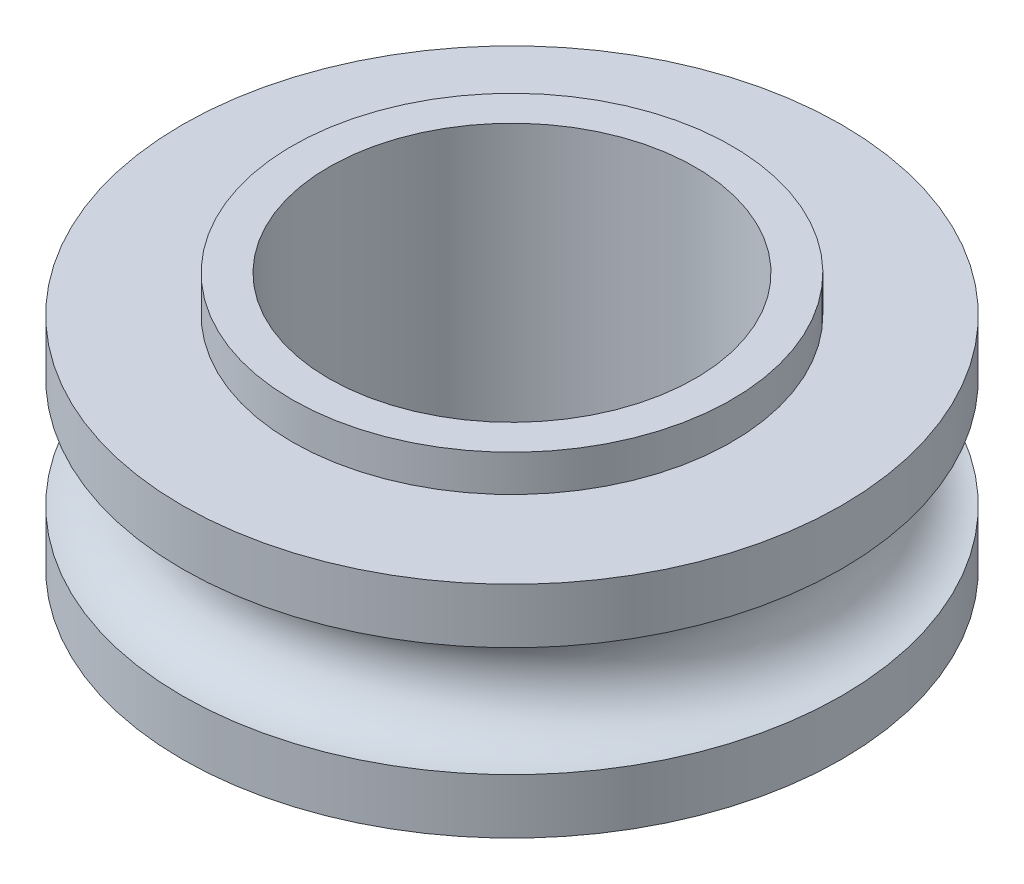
ISO-10303-21;
HEADER;
FILE_DESCRIPTION(('STEP AP214'),'2;1');
FILE_NAME('part.step','',(''),(''),'','','');
FILE_SCHEMA(('AUTOMOTIVE_DESIGN { 1 0 10303 214 1 1 1 1 }'));
ENDSEC;
DATA;
#1=APPLICATION_CONTEXT('core data for automotive mechanical design processes');
#2=APPLICATION_PROTOCOL_DEFINITION('international standard','automotive_design',2000,#1);
#3=PRODUCT_CONTEXT('',#1,'mechanical');
#4=PRODUCT('Part','Part','',(#3));
#5=PRODUCT_RELATED_PRODUCT_CATEGORY('part','',(#4));
#6=PRODUCT_DEFINITION_FORMATION('','',#4);
#7=PRODUCT_DEFINITION_CONTEXT('part definition',#1,'design');
#8=PRODUCT_DEFINITION('design','',#6,#7);
#9=PRODUCT_DEFINITION_SHAPE('','',#8);
#10=(LENGTH_UNIT() NAMED_UNIT(*) SI_UNIT(.MILLI.,.METRE.));
#11=(NAMED_UNIT(*) PLANE_ANGLE_UNIT() SI_UNIT($,.RADIAN.));
#12=(NAMED_UNIT(*) SI_UNIT($,.STERADIAN.) SOLID_ANGLE_UNIT());
#13=UNCERTAINTY_MEASURE_WITH_UNIT(LENGTH_MEASURE(1.E-05),#10,'distance_accuracy_value','');
#14=(GEOMETRIC_REPRESENTATION_CONTEXT(3) GLOBAL_UNCERTAINTY_ASSIGNED_CONTEXT((#13)) GLOBAL_UNIT_ASSIGNED_CONTEXT((#10,
#11,#12)) REPRESENTATION_CONTEXT('',''));
#15=CARTESIAN_POINT('',(0.,0.,0.));
#16=DIRECTION('',(0.,0.,1.));
#17=DIRECTION('',(1.,0.,0.));
#18=AXIS2_PLACEMENT_3D('',#15,#16,#17);
#19=CARTESIAN_POINT('',(0.,26.6473214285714,0.));
#20=DIRECTION('',(0.,1.,0.));
#21=DIRECTION('',(0.,0.,1.));
#22=AXIS2_PLACEMENT_3D('',#19,#20,#21);
#23=CYLINDRICAL_SURFACE('',#22,15.875);
#24=CARTESIAN_POINT('',(0.,-12.7,0.));
#25=DIRECTION('',(0.,1.,0.));
#26=DIRECTION('',(0.,0.,1.));
#27=AXIS2_PLACEMENT_3D('',#24,#25,#26);
#28=CIRCLE('',#27,15.875);
#29=CARTESIAN_POINT('',(0.,-12.7,15.875));
#30=VERTEX_POINT('',#29);
#31=EDGE_CURVE('E10',#30,#30,#28,.T.);
#32=ORIENTED_EDGE('',*,*,#31,.F.);
#33=EDGE_LOOP('',(#32));
#34=FACE_BOUND('',#33,.T.);
#35=CARTESIAN_POINT('',(0.,12.7,0.));
#36=DIRECTION('',(0.,1.,0.));
#37=DIRECTION('',(0.,0.,1.));
#38=AXIS2_PLACEMENT_3D('',#35,#36,#37);
#39=CIRCLE('',#38,15.875);
#40=CARTESIAN_POINT('',(0.,12.7,15.875));
#41=VERTEX_POINT('',#40);
#42=EDGE_CURVE('E64',#41,#41,#39,.T.);
#43=ORIENTED_EDGE('',*,*,#42,.T.);
#44=EDGE_LOOP('',(#43));
#45=FACE_BOUND('',#44,.T.);
#46=ADVANCED_FACE('F30',(#34,#45),#23,.F.);
#47=CARTESIAN_POINT('',(15.875,-12.7,0.));
#48=DIRECTION('',(0.,1.,0.));
#49=DIRECTION('',(0.,0.,1.));
#50=AXIS2_PLACEMENT_3D('',#47,#48,#49);
#51=PLANE('',#50);
#52=CARTESIAN_POINT('',(0.,-12.7,0.));
#53=DIRECTION('',(0.,1.,0.));
#54=DIRECTION('',(0.,0.,1.));
#55=AXIS2_PLACEMENT_3D('',#52,#53,#54);
#56=CIRCLE('',#55,19.05);
#57=CARTESIAN_POINT('',(0.,-12.7,19.05));
#58=VERTEX_POINT('',#57);
#59=EDGE_CURVE('E36',#58,#58,#56,.T.);
#60=ORIENTED_EDGE('',*,*,#59,.F.);
#61=EDGE_LOOP('',(#60));
#62=FACE_BOUND('',#61,.T.);
#63=ORIENTED_EDGE('',*,*,#31,.T.);
#64=EDGE_LOOP('',(#63));
#65=FACE_BOUND('',#64,.T.);
#66=ADVANCED_FACE('F113',(#62,#65),#51,.F.);
#67=CARTESIAN_POINT('',(0.,26.6473214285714,0.));
#68=DIRECTION('',(0.,1.,0.));
#69=DIRECTION('',(0.,0.,1.));
#70=AXIS2_PLACEMENT_3D('',#67,#68,#69);
#71=CYLINDRICAL_SURFACE('',#70,19.05);
#72=CARTESIAN_POINT('',(0.,-9.525,0.));
#73=DIRECTION('',(0.,1.,0.));
#74=DIRECTION('',(0.,0.,1.));
#75=AXIS2_PLACEMENT_3D('',#72,#73,#74);
#76=CIRCLE('',#75,19.05);
#77=CARTESIAN_POINT('',(0.,-9.525,19.05));
#78=VERTEX_POINT('',#77);
#79=EDGE_CURVE('E40',#78,#78,#76,.T.);
#80=ORIENTED_EDGE('',*,*,#79,.F.);
#81=EDGE_LOOP('',(#80));
#82=FACE_BOUND('',#81,.T.);
#83=ORIENTED_EDGE('',*,*,#59,.T.);
#84=EDGE_LOOP('',(#83));
#85=FACE_BOUND('',#84,.T.);
#86=ADVANCED_FACE('F108',(#82,#85),#71,.T.);
#87=CARTESIAN_POINT('',(19.05,-9.525,0.));
#88=DIRECTION('',(0.,1.,0.));
#89=DIRECTION('',(0.,0.,1.));
#90=AXIS2_PLACEMENT_3D('',#87,#88,#89);
#91=PLANE('',#90);
#92=CARTESIAN_POINT('',(0.,-9.525,0.));
#93=DIRECTION('',(0.,1.,0.));
#94=DIRECTION('',(0.,0.,1.));
#95=AXIS2_PLACEMENT_3D('',#92,#93,#94);
#96=CIRCLE('',#95,28.575);
#97=CARTESIAN_POINT('',(0.,-9.525,28.575));
#98=VERTEX_POINT('',#97);
#99=EDGE_CURVE('E44',#98,#98,#96,.T.);
#100=ORIENTED_EDGE('',*,*,#99,.F.);
#101=EDGE_LOOP('',(#100));
#102=FACE_BOUND('',#101,.T.);
#103=ORIENTED_EDGE('',*,*,#79,.T.);
#104=EDGE_LOOP('',(#103));
#105=FACE_BOUND('',#104,.T.);
#106=ADVANCED_FACE('F102',(#102,#105),#91,.F.);
#107=CARTESIAN_POINT('',(0.,26.6473214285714,0.));
#108=DIRECTION('',(0.,1.,0.));
#109=DIRECTION('',(0.,0.,1.));
#110=AXIS2_PLACEMENT_3D('',#107,#108,#109);
#111=CYLINDRICAL_SURFACE('',#110,28.575);
#112=CARTESIAN_POINT('',(0.,-4.7625,0.));
#113=DIRECTION('',(0.,1.,0.));
#114=DIRECTION('',(0.,0.,1.));
#115=AXIS2_PLACEMENT_3D('',#112,#113,#114);
#116=CIRCLE('',#115,28.575);
#117=CARTESIAN_POINT('',(0.,-4.7625,28.575));
#118=VERTEX_POINT('',#117);
#119=EDGE_CURVE('E49',#118,#118,#116,.T.);
#120=ORIENTED_EDGE('',*,*,#119,.F.);
#121=EDGE_LOOP('',(#120));
#122=FACE_BOUND('',#121,.T.);
#123=ORIENTED_EDGE('',*,*,#99,.T.);
#124=EDGE_LOOP('',(#123));
#125=FACE_BOUND('',#124,.T.);
#126=ADVANCED_FACE('F96',(#122,#125),#111,.T.);
#127=CARTESIAN_POINT('',(0.,0.,0.));
#128=DIRECTION('',(0.,1.,0.));
#129=DIRECTION('',(0.,0.,1.));
#130=AXIS2_PLACEMENT_3D('',#127,#128,#129);
#131=TOROIDAL_SURFACE('',#130,28.575,4.7625);
#132=CARTESIAN_POINT('',(0.,4.7625,0.));
#133=DIRECTION('',(0.,1.,0.));
#134=DIRECTION('',(0.,0.,1.));
#135=AXIS2_PLACEMENT_3D('',#132,#133,#134);
#136=CIRCLE('',#135,28.575);
#137=CARTESIAN_POINT('',(0.,4.7625,28.575));
#138=VERTEX_POINT('',#137);
#139=EDGE_CURVE('E52',#138,#138,#136,.T.);
#140=ORIENTED_EDGE('',*,*,#139,.F.);
#141=EDGE_LOOP('',(#140));
#142=FACE_BOUND('',#141,.T.);
#143=ORIENTED_EDGE('',*,*,#119,.T.);
#144=EDGE_LOOP('',(#143));
#145=FACE_BOUND('',#144,.T.);
#146=ADVANCED_FACE('F90',(#142,#145),#131,.F.);
#147=CARTESIAN_POINT('',(0.,26.6473214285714,0.));
#148=DIRECTION('',(0.,1.,0.));
#149=DIRECTION('',(0.,0.,1.));
#150=AXIS2_PLACEMENT_3D('',#147,#148,#149);
#151=CYLINDRICAL_SURFACE('',#150,28.575);
#152=CARTESIAN_POINT('',(0.,9.525,0.));
#153=DIRECTION('',(0.,1.,0.));
#154=DIRECTION('',(0.,0.,1.));
#155=AXIS2_PLACEMENT_3D('',#152,#153,#154);
#156=CIRCLE('',#155,28.575);
#157=CARTESIAN_POINT('',(0.,9.525,28.575));
#158=VERTEX_POINT('',#157);
#159=EDGE_CURVE('E55',#158,#158,#156,.T.);
#160=ORIENTED_EDGE('',*,*,#159,.F.);
#161=EDGE_LOOP('',(#160));
#162=FACE_BOUND('',#161,.T.);
#163=ORIENTED_EDGE('',*,*,#139,.T.);
#164=EDGE_LOOP('',(#163));
#165=FACE_BOUND('',#164,.T.);
#166=ADVANCED_FACE('F84',(#162,#165),#151,.T.);
#167=CARTESIAN_POINT('',(19.05,9.525,0.));
#168=DIRECTION('',(0.,-1.,0.));
#169=DIRECTION('',(0.,0.,-1.));
#170=AXIS2_PLACEMENT_3D('',#167,#168,#169);
#171=PLANE('',#170);
#172=CARTESIAN_POINT('',(0.,9.525,0.));
#173=DIRECTION('',(0.,1.,0.));
#174=DIRECTION('',(0.,0.,1.));
#175=AXIS2_PLACEMENT_3D('',#172,#173,#174);
#176=CIRCLE('',#175,19.05);
#177=CARTESIAN_POINT('',(0.,9.525,19.05));
#178=VERTEX_POINT('',#177);
#179=EDGE_CURVE('E58',#178,#178,#176,.T.);
#180=ORIENTED_EDGE('',*,*,#179,.F.);
#181=EDGE_LOOP('',(#180));
#182=FACE_BOUND('',#181,.T.);
#183=ORIENTED_EDGE('',*,*,#159,.T.);
#184=EDGE_LOOP('',(#183));
#185=FACE_BOUND('',#184,.T.);
#186=ADVANCED_FACE('F78',(#182,#185),#171,.F.);
#187=CARTESIAN_POINT('',(0.,26.6473214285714,0.));
#188=DIRECTION('',(0.,1.,0.));
#189=DIRECTION('',(0.,0.,1.));
#190=AXIS2_PLACEMENT_3D('',#187,#188,#189);
#191=CYLINDRICAL_SURFACE('',#190,19.05);
#192=CARTESIAN_POINT('',(0.,12.7,0.));
#193=DIRECTION('',(0.,1.,0.));
#194=DIRECTION('',(0.,0.,1.));
#195=AXIS2_PLACEMENT_3D('',#192,#193,#194);
#196=CIRCLE('',#195,19.05);
#197=CARTESIAN_POINT('',(0.,12.7,19.05));
#198=VERTEX_POINT('',#197);
#199=EDGE_CURVE('E61',#198,#198,#196,.T.);
#200=ORIENTED_EDGE('',*,*,#199,.F.);
#201=EDGE_LOOP('',(#200));
#202=FACE_BOUND('',#201,.T.);
#203=ORIENTED_EDGE('',*,*,#179,.T.);
#204=EDGE_LOOP('',(#203));
#205=FACE_BOUND('',#204,.T.);
#206=ADVANCED_FACE('F72',(#202,#205),#191,.T.);
#207=CARTESIAN_POINT('',(15.875,12.7,0.));
#208=DIRECTION('',(0.,-1.,0.));
#209=DIRECTION('',(0.,0.,-1.));
#210=AXIS2_PLACEMENT_3D('',#207,#208,#209);
#211=PLANE('',#210);
#212=ORIENTED_EDGE('',*,*,#42,.F.);
#213=EDGE_LOOP('',(#212));
#214=FACE_BOUND('',#213,.T.);
#215=ORIENTED_EDGE('',*,*,#199,.T.);
#216=EDGE_LOOP('',(#215));
#217=FACE_BOUND('',#216,.T.);
#218=ADVANCED_FACE('F69',(#214,#217),#211,.F.);
#219=CLOSED_SHELL('',(#46,#66,#86,#106,#126,#146,#166,#186,#206,#218));
#220=MANIFOLD_SOLID_BREP('B2',#219);
#221=ADVANCED_BREP_SHAPE_REPRESENTATION('',(#18,#220),#14);
#222=SHAPE_DEFINITION_REPRESENTATION(#9,#221);
ENDSEC;
END-ISO-10303-21;
